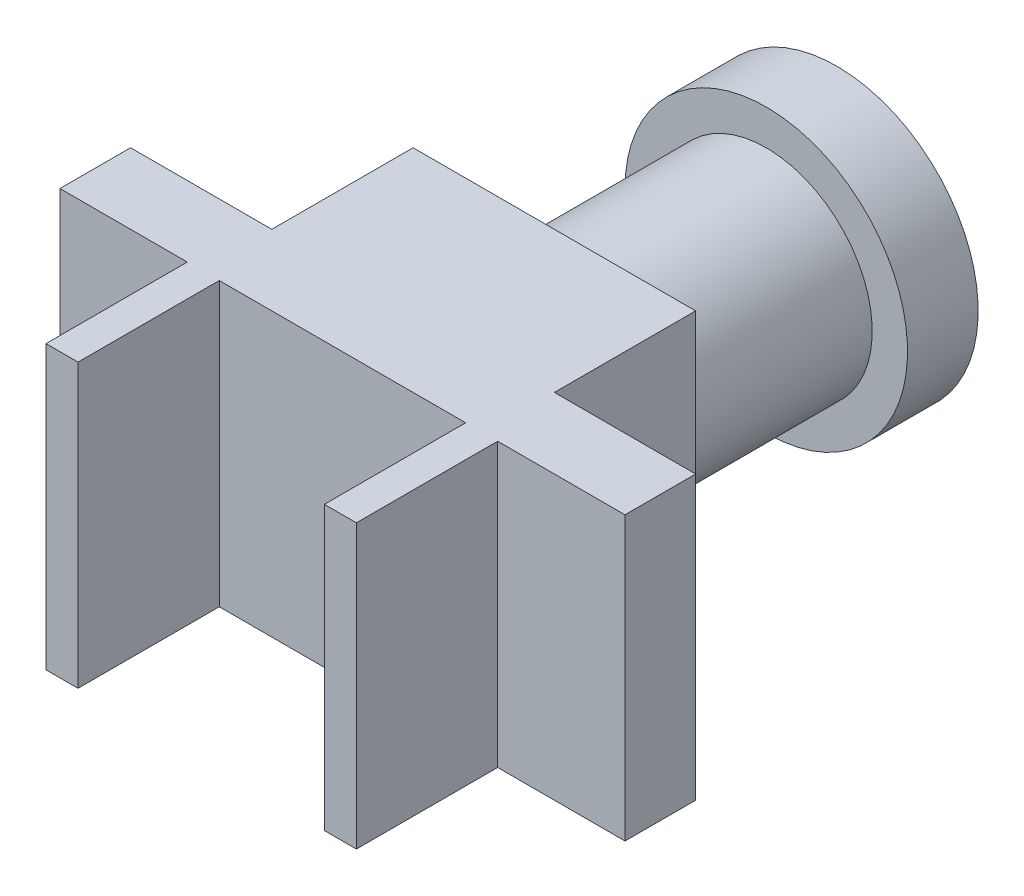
from build123d import *

# Parameters (mm, degrees)
SKETCH1_R           = 15
BOSS_EXTRUDE1_DEPTH = 15
SKETCH2_R           = 20
BOSS_EXTRUDE2_DEPTH = 10
SKETCH3_W           = 40
SKETCH3_H           = 40
BOSS_EXTRUDE3_DEPTH = 20
SKETCH4_W           = 80
SKETCH4_H           = 40
BOSS_EXTRUDE4_DEPTH = 10
SKETCH5_W           = 4.531505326
SKETCH5_H           = 40
BOSS_EXTRUDE5_DEPTH = 20


with BuildPart() as part:
    # Sketch1 → Boss-Extrude1 (new, symmetric)
    with BuildSketch(Plane.XY):
        Circle(SKETCH1_R)
    extrude(amount=BOSS_EXTRUDE1_DEPTH, both=True)

    # Sketch2 → Boss-Extrude2 (add)
    with BuildSketch(Plane(origin=(0, 0, -15), x_dir=(-1, 0, 0), z_dir=(0, 0, -1))):
        Circle(SKETCH2_R)
    extrude(amount=BOSS_EXTRUDE2_DEPTH)

    # Sketch3 → Boss-Extrude3 (add)
    with BuildSketch(Plane.XY.offset(15)):
        Rectangle(SKETCH3_W, SKETCH3_H)
    extrude(amount=BOSS_EXTRUDE3_DEPTH)

    # Sketch4 → Boss-Extrude4 (add)
    with BuildSketch(Plane.XY.offset(35)):
        Rectangle(SKETCH4_W, SKETCH4_H)
    extrude(amount=BOSS_EXTRUDE4_DEPTH)

    # Sketch5 → Boss-Extrude5 (add)
    with BuildSketch(Plane.XY.offset(45)):
        with Locations((-19.705182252, 0)):
            Rectangle(SKETCH5_W, SKETCH5_H)
    boss_extrude5 = extrude(amount=BOSS_EXTRUDE5_DEPTH)

    # Mirror1: Boss-Extrude5 across plane
    add(boss_extrude5.mirror(Plane(origin=(0, 0, 0), x_dir=(0, 0, 1), z_dir=(1, 0, 0))))


solid = part.part
